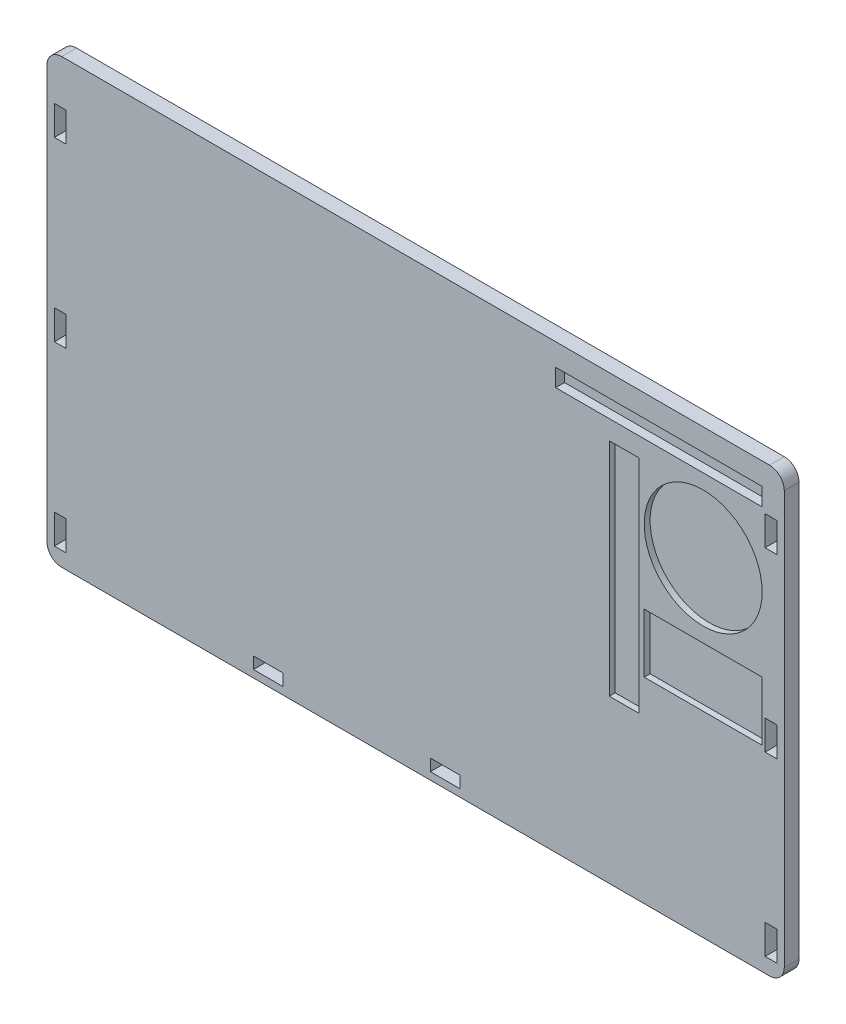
from build123d import *

# Parameters (mm, degrees)
SKETCH1_W           = 8
SKETCH1_H           = 20
SKETCH1_W_2         = 20
SKETCH1_H_2         = 8
BOSS_EXTRUDE1_DEPTH = 10
SKETCH4_W           = 140
SKETCH4_H           = 12
CUT_EXTRUDE5_DEPTH  = 6
SKETCH5_W           = 80
SKETCH5_H           = 40
CUT_EXTRUDE6_DEPTH  = 4
SKETCH6_R           = 40
CUT_EXTRUDE11_DEPTH = 4
SKETCH8_W           = 20
SKETCH8_H           = 150
CUT_EXTRUDE12_DEPTH = 4


with BuildPart() as part:
    # Sketch1 → Boss-Extrude1 (new body)
    with BuildSketch(Plane.XY):
        with BuildLine():
            Line((-240, 150), (240, 150))
            ThreePointArc((240, 150), (247.071067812, 147.071067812), (250, 140))
            Line((250, 140), (250, -140))
            ThreePointArc((250, -140), (247.071067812, -147.071067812), (240, -150))
            Line((240, -150), (-240, -150))
            ThreePointArc((-240, -150), (-247.071067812, -147.071067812), (-250, -140))
            Line((-250, -140), (-250, 140))
            ThreePointArc((-250, 140), (-247.071067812, 147.071067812), (-240, 150))
        make_face()
        with Locations((-241, 110)):
            Rectangle(SKETCH1_W, SKETCH1_H, mode=Mode.SUBTRACT)
        with Locations((-241, -10)):
            Rectangle(SKETCH1_W, SKETCH1_H, mode=Mode.SUBTRACT)
        with Locations((-241, -130)):
            Rectangle(SKETCH1_W, SKETCH1_H, mode=Mode.SUBTRACT)
        with Locations((241, -130)):
            Rectangle(SKETCH1_W, SKETCH1_H, mode=Mode.SUBTRACT)
        with Locations((241, -10)):
            Rectangle(SKETCH1_W, SKETCH1_H, mode=Mode.SUBTRACT)
        with Locations((241, 110)):
            Rectangle(SKETCH1_W, SKETCH1_H, mode=Mode.SUBTRACT)
        with Locations((-100, -141)):
            Rectangle(SKETCH1_W_2, SKETCH1_H_2, mode=Mode.SUBTRACT)
        with Locations((20, -141)):
            Rectangle(SKETCH1_W_2, SKETCH1_H_2, mode=Mode.SUBTRACT)
    extrude(amount=BOSS_EXTRUDE1_DEPTH)

    # Sketch4 → Cut-Extrude5 (cut)
    with BuildSketch(Plane.XY.offset(10)):
        with Locations((165, 129)):
            Rectangle(SKETCH4_W, SKETCH4_H)
    extrude(amount=-CUT_EXTRUDE5_DEPTH, mode=Mode.SUBTRACT)

    # Sketch5 → Cut-Extrude6 (cut)
    with BuildSketch(Plane.XY.offset(10)):
        with Locations((195, 3)):
            Rectangle(SKETCH5_W, SKETCH5_H)
    extrude(amount=-CUT_EXTRUDE6_DEPTH, mode=Mode.SUBTRACT)

    # Sketch6 → Cut-Extrude11 (cut)
    with BuildSketch(Plane.XY.offset(10)):
        with Locations((195, 73)):
            Circle(SKETCH6_R)
    extrude(amount=-CUT_EXTRUDE11_DEPTH, mode=Mode.SUBTRACT)

    # Sketch8 → Cut-Extrude12 (cut)
    with BuildSketch(Plane.XY.offset(10)):
        with Locations((141.333930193, 35)):
            Rectangle(SKETCH8_W, SKETCH8_H)
    extrude(amount=-CUT_EXTRUDE12_DEPTH, mode=Mode.SUBTRACT)


solid = part.part
